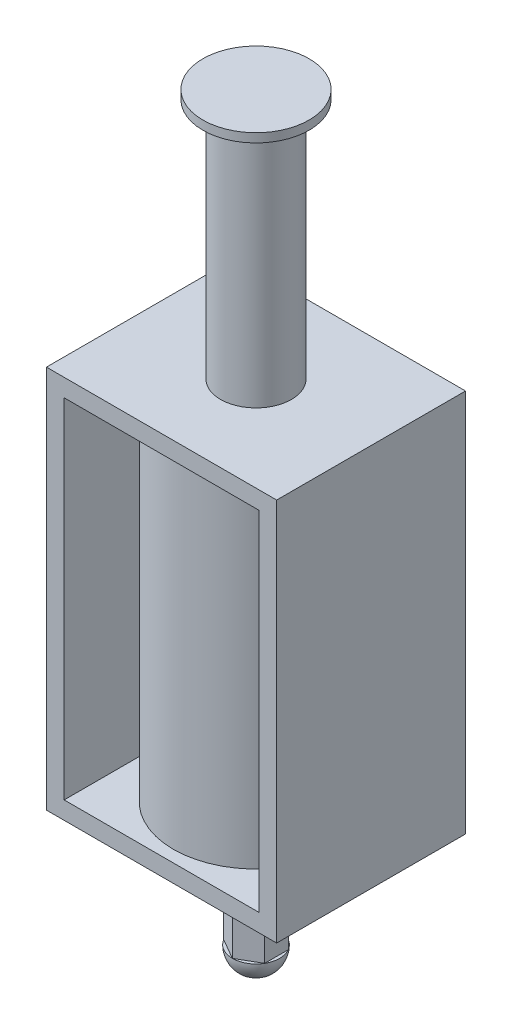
ISO-10303-21;
HEADER;
FILE_DESCRIPTION(('STEP AP214'),'2;1');
FILE_NAME('part.step','',(''),(''),'','','');
FILE_SCHEMA(('AUTOMOTIVE_DESIGN { 1 0 10303 214 1 1 1 1 }'));
ENDSEC;
DATA;
#1=APPLICATION_CONTEXT('core data for automotive mechanical design processes');
#2=APPLICATION_PROTOCOL_DEFINITION('international standard','automotive_design',2000,#1);
#3=PRODUCT_CONTEXT('',#1,'mechanical');
#4=PRODUCT('Part','Part','',(#3));
#5=PRODUCT_RELATED_PRODUCT_CATEGORY('part','',(#4));
#6=PRODUCT_DEFINITION_FORMATION('','',#4);
#7=PRODUCT_DEFINITION_CONTEXT('part definition',#1,'design');
#8=PRODUCT_DEFINITION('design','',#6,#7);
#9=PRODUCT_DEFINITION_SHAPE('','',#8);
#10=(LENGTH_UNIT() NAMED_UNIT(*) SI_UNIT(.MILLI.,.METRE.));
#11=(NAMED_UNIT(*) PLANE_ANGLE_UNIT() SI_UNIT($,.RADIAN.));
#12=(NAMED_UNIT(*) SI_UNIT($,.STERADIAN.) SOLID_ANGLE_UNIT());
#13=UNCERTAINTY_MEASURE_WITH_UNIT(LENGTH_MEASURE(1.E-05),#10,'distance_accuracy_value','');
#14=(GEOMETRIC_REPRESENTATION_CONTEXT(3) GLOBAL_UNCERTAINTY_ASSIGNED_CONTEXT((#13)) GLOBAL_UNIT_ASSIGNED_CONTEXT((#10,
#11,#12)) REPRESENTATION_CONTEXT('',''));
#15=CARTESIAN_POINT('',(0.,0.,0.));
#16=DIRECTION('',(0.,0.,1.));
#17=DIRECTION('',(1.,0.,0.));
#18=AXIS2_PLACEMENT_3D('',#15,#16,#17);
#19=CARTESIAN_POINT('',(0.,-50.5,16.));
#20=DIRECTION('',(0.,1.,0.));
#21=DIRECTION('',(0.,0.,1.));
#22=AXIS2_PLACEMENT_3D('',#19,#20,#21);
#23=CYLINDRICAL_SURFACE('',#22,4.);
#24=CARTESIAN_POINT('',(0.,-32.5,16.));
#25=DIRECTION('',(0.,-1.,0.));
#26=DIRECTION('',(0.,0.,-1.));
#27=AXIS2_PLACEMENT_3D('',#24,#25,#26);
#28=CIRCLE('',#27,4.);
#29=CARTESIAN_POINT('',(0.,-32.5,12.));
#30=VERTEX_POINT('',#29);
#31=EDGE_CURVE('E222',#30,#30,#28,.T.);
#32=ORIENTED_EDGE('',*,*,#31,.T.);
#33=EDGE_LOOP('',(#32));
#34=FACE_BOUND('',#33,.T.);
#35=CARTESIAN_POINT('',(0.,-39.5,16.));
#36=DIRECTION('',(0.,-1.,0.));
#37=DIRECTION('',(0.,0.,-1.));
#38=AXIS2_PLACEMENT_3D('',#35,#36,#37);
#39=CIRCLE('',#38,4.);
#40=CARTESIAN_POINT('',(-3.46410161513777,-39.5,18.));
#41=VERTEX_POINT('',#40);
#42=CARTESIAN_POINT('',(-3.46410161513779,-39.5,14.));
#43=VERTEX_POINT('',#42);
#44=EDGE_CURVE('E12',#41,#43,#39,.T.);
#45=ORIENTED_EDGE('',*,*,#44,.F.);
#46=CARTESIAN_POINT('',(0.,-39.5,20.));
#47=VERTEX_POINT('',#46);
#48=EDGE_CURVE('E53',#47,#41,#39,.T.);
#49=ORIENTED_EDGE('',*,*,#48,.F.);
#50=CARTESIAN_POINT('',(3.46410161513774,-39.5,18.));
#51=VERTEX_POINT('',#50);
#52=EDGE_CURVE('E671',#51,#47,#39,.T.);
#53=ORIENTED_EDGE('',*,*,#52,.F.);
#54=CARTESIAN_POINT('',(3.46410161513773,-39.5,14.));
#55=VERTEX_POINT('',#54);
#56=EDGE_CURVE('E668',#55,#51,#39,.T.);
#57=ORIENTED_EDGE('',*,*,#56,.F.);
#58=CARTESIAN_POINT('',(0.,-39.5,12.));
#59=VERTEX_POINT('',#58);
#60=EDGE_CURVE('E667',#59,#55,#39,.T.);
#61=ORIENTED_EDGE('',*,*,#60,.F.);
#62=EDGE_CURVE('E48',#43,#59,#39,.T.);
#63=ORIENTED_EDGE('',*,*,#62,.F.);
#64=EDGE_LOOP('',(#45,#49,#53,#57,#61,#63));
#65=FACE_BOUND('',#64,.T.);
#66=ADVANCED_FACE('F44',(#34,#65),#23,.T.);
#67=CARTESIAN_POINT('',(-19.5,-32.5,32.));
#68=DIRECTION('',(0.,1.,0.));
#69=DIRECTION('',(0.,0.,1.));
#70=AXIS2_PLACEMENT_3D('',#67,#68,#69);
#71=PLANE('',#70);
#72=ORIENTED_EDGE('',*,*,#31,.F.);
#73=EDGE_LOOP('',(#72));
#74=FACE_BOUND('',#73,.T.);
#75=DIRECTION('',(1.,0.,0.));
#76=VECTOR('',#75,1.);
#77=CARTESIAN_POINT('',(-19.5,-32.5,0.));
#78=LINE('',#77,#76);
#79=CARTESIAN_POINT('',(-19.5,-32.5,0.));
#80=VERTEX_POINT('',#79);
#81=CARTESIAN_POINT('',(19.5,-32.5,0.));
#82=VERTEX_POINT('',#81);
#83=EDGE_CURVE('E264',#80,#82,#78,.T.);
#84=ORIENTED_EDGE('',*,*,#83,.T.);
#85=DIRECTION('',(0.,0.,-1.));
#86=VECTOR('',#85,1.);
#87=CARTESIAN_POINT('',(19.5,-32.5,32.));
#88=LINE('',#87,#86);
#89=CARTESIAN_POINT('',(19.5,-32.5,32.));
#90=VERTEX_POINT('',#89);
#91=EDGE_CURVE('E238',#90,#82,#88,.T.);
#92=ORIENTED_EDGE('',*,*,#91,.F.);
#93=DIRECTION('',(1.,0.,0.));
#94=VECTOR('',#93,1.);
#95=CARTESIAN_POINT('',(-19.5,-32.5,32.));
#96=LINE('',#95,#94);
#97=CARTESIAN_POINT('',(-19.5,-32.5,32.));
#98=VERTEX_POINT('',#97);
#99=EDGE_CURVE('E270',#98,#90,#96,.T.);
#100=ORIENTED_EDGE('',*,*,#99,.F.);
#101=DIRECTION('',(0.,0.,-1.));
#102=VECTOR('',#101,1.);
#103=CARTESIAN_POINT('',(-19.5,-32.5,32.));
#104=LINE('',#103,#102);
#105=EDGE_CURVE('E281',#98,#80,#104,.T.);
#106=ORIENTED_EDGE('',*,*,#105,.T.);
#107=EDGE_LOOP('',(#84,#92,#100,#106));
#108=FACE_BOUND('',#107,.T.);
#109=ADVANCED_FACE('F46',(#74,#108),#71,.F.);
#110=CARTESIAN_POINT('',(19.5,32.5,32.));
#111=DIRECTION('',(1.,0.,0.));
#112=DIRECTION('',(0.,1.,0.));
#113=AXIS2_PLACEMENT_3D('',#110,#111,#112);
#114=PLANE('',#113);
#115=DIRECTION('',(0.,-1.,0.));
#116=VECTOR('',#115,1.);
#117=CARTESIAN_POINT('',(19.5,32.5,0.));
#118=LINE('',#117,#116);
#119=CARTESIAN_POINT('',(19.5,32.5,0.));
#120=VERTEX_POINT('',#119);
#121=EDGE_CURVE('E284',#120,#82,#118,.T.);
#122=ORIENTED_EDGE('',*,*,#121,.F.);
#123=DIRECTION('',(0.,0.,-1.));
#124=VECTOR('',#123,1.);
#125=CARTESIAN_POINT('',(19.5,32.5,32.));
#126=LINE('',#125,#124);
#127=CARTESIAN_POINT('',(19.5,32.5,32.));
#128=VERTEX_POINT('',#127);
#129=EDGE_CURVE('E295',#128,#120,#126,.T.);
#130=ORIENTED_EDGE('',*,*,#129,.F.);
#131=DIRECTION('',(0.,-1.,0.));
#132=VECTOR('',#131,1.);
#133=CARTESIAN_POINT('',(19.5,32.5,32.));
#134=LINE('',#133,#132);
#135=EDGE_CURVE('E272',#128,#90,#134,.T.);
#136=ORIENTED_EDGE('',*,*,#135,.T.);
#137=ORIENTED_EDGE('',*,*,#91,.T.);
#138=EDGE_LOOP('',(#122,#130,#136,#137));
#139=FACE_BOUND('',#138,.T.);
#140=ADVANCED_FACE('F344',(#139),#114,.T.);
#141=CARTESIAN_POINT('',(-19.5,32.5,32.));
#142=DIRECTION('',(0.,1.,0.));
#143=DIRECTION('',(0.,0.,1.));
#144=AXIS2_PLACEMENT_3D('',#141,#142,#143);
#145=PLANE('',#144);
#146=CARTESIAN_POINT('',(0.,32.5,16.));
#147=DIRECTION('',(0.,1.,0.));
#148=DIRECTION('',(0.,0.,1.));
#149=AXIS2_PLACEMENT_3D('',#146,#147,#148);
#150=CIRCLE('',#149,6.);
#151=CARTESIAN_POINT('',(0.,32.5,22.));
#152=VERTEX_POINT('',#151);
#153=EDGE_CURVE('E234',#152,#152,#150,.T.);
#154=ORIENTED_EDGE('',*,*,#153,.F.);
#155=EDGE_LOOP('',(#154));
#156=FACE_BOUND('',#155,.T.);
#157=DIRECTION('',(1.,0.,0.));
#158=VECTOR('',#157,1.);
#159=CARTESIAN_POINT('',(-19.5,32.5,0.));
#160=LINE('',#159,#158);
#161=CARTESIAN_POINT('',(-19.5,32.5,0.));
#162=VERTEX_POINT('',#161);
#163=EDGE_CURVE('E287',#162,#120,#160,.T.);
#164=ORIENTED_EDGE('',*,*,#163,.F.);
#165=DIRECTION('',(0.,0.,-1.));
#166=VECTOR('',#165,1.);
#167=CARTESIAN_POINT('',(-19.5,32.5,32.));
#168=LINE('',#167,#166);
#169=CARTESIAN_POINT('',(-19.5,32.5,32.));
#170=VERTEX_POINT('',#169);
#171=EDGE_CURVE('E293',#170,#162,#168,.T.);
#172=ORIENTED_EDGE('',*,*,#171,.F.);
#173=DIRECTION('',(1.,0.,0.));
#174=VECTOR('',#173,1.);
#175=CARTESIAN_POINT('',(-19.5,32.5,32.));
#176=LINE('',#175,#174);
#177=EDGE_CURVE('E276',#170,#128,#176,.T.);
#178=ORIENTED_EDGE('',*,*,#177,.T.);
#179=ORIENTED_EDGE('',*,*,#129,.T.);
#180=EDGE_LOOP('',(#164,#172,#178,#179));
#181=FACE_BOUND('',#180,.T.);
#182=ADVANCED_FACE('F373',(#156,#181),#145,.T.);
#183=CARTESIAN_POINT('',(-19.5,32.5,32.));
#184=DIRECTION('',(1.,0.,0.));
#185=DIRECTION('',(0.,1.,0.));
#186=AXIS2_PLACEMENT_3D('',#183,#184,#185);
#187=PLANE('',#186);
#188=DIRECTION('',(0.,-1.,0.));
#189=VECTOR('',#188,1.);
#190=CARTESIAN_POINT('',(-19.5,32.5,0.));
#191=LINE('',#190,#189);
#192=EDGE_CURVE('E273',#162,#80,#191,.T.);
#193=ORIENTED_EDGE('',*,*,#192,.T.);
#194=ORIENTED_EDGE('',*,*,#105,.F.);
#195=DIRECTION('',(0.,-1.,0.));
#196=VECTOR('',#195,1.);
#197=CARTESIAN_POINT('',(-19.5,32.5,32.));
#198=LINE('',#197,#196);
#199=EDGE_CURVE('E279',#170,#98,#198,.T.);
#200=ORIENTED_EDGE('',*,*,#199,.F.);
#201=ORIENTED_EDGE('',*,*,#171,.T.);
#202=EDGE_LOOP('',(#193,#194,#200,#201));
#203=FACE_BOUND('',#202,.T.);
#204=ADVANCED_FACE('F375',(#203),#187,.F.);
#205=CARTESIAN_POINT('',(0.,0.,32.));
#206=DIRECTION('',(0.,0.,-1.));
#207=DIRECTION('',(-1.,0.,0.));
#208=AXIS2_PLACEMENT_3D('',#205,#206,#207);
#209=PLANE('',#208);
#210=DIRECTION('',(-1.,0.,0.));
#211=VECTOR('',#210,1.);
#212=CARTESIAN_POINT('',(-16.5,29.5,32.));
#213=LINE('',#212,#211);
#214=CARTESIAN_POINT('',(16.5,29.5,32.));
#215=VERTEX_POINT('',#214);
#216=CARTESIAN_POINT('',(-16.5,29.5,32.));
#217=VERTEX_POINT('',#216);
#218=EDGE_CURVE('E254',#215,#217,#213,.T.);
#219=ORIENTED_EDGE('',*,*,#218,.F.);
#220=DIRECTION('',(0.,1.,0.));
#221=VECTOR('',#220,1.);
#222=CARTESIAN_POINT('',(16.5,29.5,32.));
#223=LINE('',#222,#221);
#224=CARTESIAN_POINT('',(16.5,-29.5,32.));
#225=VERTEX_POINT('',#224);
#226=EDGE_CURVE('E68',#225,#215,#223,.T.);
#227=ORIENTED_EDGE('',*,*,#226,.F.);
#228=DIRECTION('',(1.,0.,0.));
#229=VECTOR('',#228,1.);
#230=CARTESIAN_POINT('',(-16.5,-29.5,32.));
#231=LINE('',#230,#229);
#232=CARTESIAN_POINT('',(-16.5,-29.5,32.));
#233=VERTEX_POINT('',#232);
#234=EDGE_CURVE('E243',#233,#225,#231,.T.);
#235=ORIENTED_EDGE('',*,*,#234,.F.);
#236=DIRECTION('',(0.,-1.,0.));
#237=VECTOR('',#236,1.);
#238=CARTESIAN_POINT('',(-16.5,29.5,32.));
#239=LINE('',#238,#237);
#240=EDGE_CURVE('E257',#217,#233,#239,.T.);
#241=ORIENTED_EDGE('',*,*,#240,.F.);
#242=EDGE_LOOP('',(#219,#227,#235,#241));
#243=FACE_BOUND('',#242,.T.);
#244=ORIENTED_EDGE('',*,*,#99,.T.);
#245=ORIENTED_EDGE('',*,*,#135,.F.);
#246=ORIENTED_EDGE('',*,*,#177,.F.);
#247=ORIENTED_EDGE('',*,*,#199,.T.);
#248=EDGE_LOOP('',(#244,#245,#246,#247));
#249=FACE_BOUND('',#248,.T.);
#250=ADVANCED_FACE('F317',(#243,#249),#209,.F.);
#251=CARTESIAN_POINT('',(0.,0.,0.));
#252=DIRECTION('',(0.,0.,-1.));
#253=DIRECTION('',(-1.,0.,0.));
#254=AXIS2_PLACEMENT_3D('',#251,#252,#253);
#255=PLANE('',#254);
#256=DIRECTION('',(0.,1.,0.));
#257=VECTOR('',#256,1.);
#258=CARTESIAN_POINT('',(16.5,29.5,0.));
#259=LINE('',#258,#257);
#260=CARTESIAN_POINT('',(16.5,-29.5,0.));
#261=VERTEX_POINT('',#260);
#262=CARTESIAN_POINT('',(16.5,29.5,0.));
#263=VERTEX_POINT('',#262);
#264=EDGE_CURVE('E239',#261,#263,#259,.T.);
#265=ORIENTED_EDGE('',*,*,#264,.T.);
#266=DIRECTION('',(-1.,0.,0.));
#267=VECTOR('',#266,1.);
#268=CARTESIAN_POINT('',(-16.5,29.5,0.));
#269=LINE('',#268,#267);
#270=CARTESIAN_POINT('',(-16.5,29.5,0.));
#271=VERTEX_POINT('',#270);
#272=EDGE_CURVE('E242',#263,#271,#269,.T.);
#273=ORIENTED_EDGE('',*,*,#272,.T.);
#274=DIRECTION('',(0.,-1.,0.));
#275=VECTOR('',#274,1.);
#276=CARTESIAN_POINT('',(-16.5,29.5,0.));
#277=LINE('',#276,#275);
#278=CARTESIAN_POINT('',(-16.5,-29.5,0.));
#279=VERTEX_POINT('',#278);
#280=EDGE_CURVE('E246',#271,#279,#277,.T.);
#281=ORIENTED_EDGE('',*,*,#280,.T.);
#282=DIRECTION('',(1.,0.,0.));
#283=VECTOR('',#282,1.);
#284=CARTESIAN_POINT('',(-16.5,-29.5,0.));
#285=LINE('',#284,#283);
#286=EDGE_CURVE('E249',#279,#261,#285,.T.);
#287=ORIENTED_EDGE('',*,*,#286,.T.);
#288=EDGE_LOOP('',(#265,#273,#281,#287));
#289=FACE_BOUND('',#288,.T.);
#290=ORIENTED_EDGE('',*,*,#83,.F.);
#291=ORIENTED_EDGE('',*,*,#192,.F.);
#292=ORIENTED_EDGE('',*,*,#163,.T.);
#293=ORIENTED_EDGE('',*,*,#121,.T.);
#294=EDGE_LOOP('',(#290,#291,#292,#293));
#295=FACE_BOUND('',#294,.T.);
#296=ADVANCED_FACE('F324',(#289,#295),#255,.T.);
#297=CARTESIAN_POINT('',(16.5,29.5,0.));
#298=DIRECTION('',(1.,0.,0.));
#299=DIRECTION('',(0.,0.,-1.));
#300=AXIS2_PLACEMENT_3D('',#297,#298,#299);
#301=PLANE('',#300);
#302=ORIENTED_EDGE('',*,*,#226,.T.);
#303=DIRECTION('',(0.,0.,1.));
#304=VECTOR('',#303,1.);
#305=CARTESIAN_POINT('',(16.5,29.5,0.));
#306=LINE('',#305,#304);
#307=EDGE_CURVE('E252',#263,#215,#306,.T.);
#308=ORIENTED_EDGE('',*,*,#307,.F.);
#309=ORIENTED_EDGE('',*,*,#264,.F.);
#310=DIRECTION('',(0.,0.,1.));
#311=VECTOR('',#310,1.);
#312=CARTESIAN_POINT('',(16.5,-29.5,0.));
#313=LINE('',#312,#311);
#314=EDGE_CURVE('E262',#261,#225,#313,.T.);
#315=ORIENTED_EDGE('',*,*,#314,.T.);
#316=EDGE_LOOP('',(#302,#308,#309,#315));
#317=FACE_BOUND('',#316,.T.);
#318=ADVANCED_FACE('F309',(#317),#301,.F.);
#319=CARTESIAN_POINT('',(-16.5,-29.5,0.));
#320=DIRECTION('',(0.,-1.,0.));
#321=DIRECTION('',(0.,0.,-1.));
#322=AXIS2_PLACEMENT_3D('',#319,#320,#321);
#323=PLANE('',#322);
#324=CARTESIAN_POINT('',(0.,-29.5,16.));
#325=DIRECTION('',(0.,-1.,0.));
#326=DIRECTION('',(0.,0.,-1.));
#327=AXIS2_PLACEMENT_3D('',#324,#325,#326);
#328=CIRCLE('',#327,14.);
#329=CARTESIAN_POINT('',(0.,-29.5,2.));
#330=VERTEX_POINT('',#329);
#331=EDGE_CURVE('E225',#330,#330,#328,.F.);
#332=ORIENTED_EDGE('',*,*,#331,.F.);
#333=EDGE_LOOP('',(#332));
#334=FACE_BOUND('',#333,.T.);
#335=ORIENTED_EDGE('',*,*,#234,.T.);
#336=ORIENTED_EDGE('',*,*,#314,.F.);
#337=ORIENTED_EDGE('',*,*,#286,.F.);
#338=DIRECTION('',(0.,0.,1.));
#339=VECTOR('',#338,1.);
#340=CARTESIAN_POINT('',(-16.5,-29.5,0.));
#341=LINE('',#340,#339);
#342=EDGE_CURVE('E265',#279,#233,#341,.T.);
#343=ORIENTED_EDGE('',*,*,#342,.T.);
#344=EDGE_LOOP('',(#335,#336,#337,#343));
#345=FACE_BOUND('',#344,.T.);
#346=ADVANCED_FACE('F305',(#334,#345),#323,.F.);
#347=CARTESIAN_POINT('',(-16.5,29.5,0.));
#348=DIRECTION('',(-1.,0.,0.));
#349=DIRECTION('',(0.,0.,1.));
#350=AXIS2_PLACEMENT_3D('',#347,#348,#349);
#351=PLANE('',#350);
#352=ORIENTED_EDGE('',*,*,#240,.T.);
#353=ORIENTED_EDGE('',*,*,#342,.F.);
#354=ORIENTED_EDGE('',*,*,#280,.F.);
#355=DIRECTION('',(0.,0.,1.));
#356=VECTOR('',#355,1.);
#357=CARTESIAN_POINT('',(-16.5,29.5,0.));
#358=LINE('',#357,#356);
#359=EDGE_CURVE('E267',#271,#217,#358,.T.);
#360=ORIENTED_EDGE('',*,*,#359,.T.);
#361=EDGE_LOOP('',(#352,#353,#354,#360));
#362=FACE_BOUND('',#361,.T.);
#363=ADVANCED_FACE('F308',(#362),#351,.F.);
#364=CARTESIAN_POINT('',(-16.5,29.5,0.));
#365=DIRECTION('',(0.,1.,0.));
#366=DIRECTION('',(0.,0.,1.));
#367=AXIS2_PLACEMENT_3D('',#364,#365,#366);
#368=PLANE('',#367);
#369=CARTESIAN_POINT('',(0.,29.5,16.));
#370=DIRECTION('',(0.,1.,0.));
#371=DIRECTION('',(0.,0.,1.));
#372=AXIS2_PLACEMENT_3D('',#369,#370,#371);
#373=CIRCLE('',#372,14.);
#374=CARTESIAN_POINT('',(0.,29.5,30.));
#375=VERTEX_POINT('',#374);
#376=EDGE_CURVE('E237',#375,#375,#373,.F.);
#377=ORIENTED_EDGE('',*,*,#376,.F.);
#378=EDGE_LOOP('',(#377));
#379=FACE_BOUND('',#378,.T.);
#380=ORIENTED_EDGE('',*,*,#218,.T.);
#381=ORIENTED_EDGE('',*,*,#359,.F.);
#382=ORIENTED_EDGE('',*,*,#272,.F.);
#383=ORIENTED_EDGE('',*,*,#307,.T.);
#384=EDGE_LOOP('',(#380,#381,#382,#383));
#385=FACE_BOUND('',#384,.T.);
#386=ADVANCED_FACE('F321',(#379,#385),#368,.F.);
#387=CARTESIAN_POINT('',(0.,73.5,16.));
#388=DIRECTION('',(0.,-1.,0.));
#389=DIRECTION('',(0.,0.,-1.));
#390=AXIS2_PLACEMENT_3D('',#387,#388,#389);
#391=CYLINDRICAL_SURFACE('',#390,6.);
#392=CARTESIAN_POINT('',(0.,73.5,16.));
#393=DIRECTION('',(0.,1.,0.));
#394=DIRECTION('',(0.,0.,1.));
#395=AXIS2_PLACEMENT_3D('',#392,#393,#394);
#396=CIRCLE('',#395,6.);
#397=CARTESIAN_POINT('',(0.,73.5,22.));
#398=VERTEX_POINT('',#397);
#399=EDGE_CURVE('E229',#398,#398,#396,.T.);
#400=ORIENTED_EDGE('',*,*,#399,.F.);
#401=EDGE_LOOP('',(#400));
#402=FACE_BOUND('',#401,.T.);
#403=ORIENTED_EDGE('',*,*,#153,.T.);
#404=EDGE_LOOP('',(#403));
#405=FACE_BOUND('',#404,.T.);
#406=ADVANCED_FACE('F334',(#402,#405),#391,.T.);
#407=CARTESIAN_POINT('',(0.,75.,16.));
#408=DIRECTION('',(0.,-1.,0.));
#409=DIRECTION('',(0.,0.,-1.));
#410=AXIS2_PLACEMENT_3D('',#407,#408,#409);
#411=CYLINDRICAL_SURFACE('',#410,9.);
#412=CARTESIAN_POINT('',(0.,75.,16.));
#413=DIRECTION('',(0.,1.,0.));
#414=DIRECTION('',(0.,0.,1.));
#415=AXIS2_PLACEMENT_3D('',#412,#413,#414);
#416=CIRCLE('',#415,9.);
#417=CARTESIAN_POINT('',(0.,75.,25.));
#418=VERTEX_POINT('',#417);
#419=EDGE_CURVE('E226',#418,#418,#416,.T.);
#420=ORIENTED_EDGE('',*,*,#419,.F.);
#421=EDGE_LOOP('',(#420));
#422=FACE_BOUND('',#421,.T.);
#423=CARTESIAN_POINT('',(0.,73.5,16.));
#424=DIRECTION('',(0.,1.,0.));
#425=DIRECTION('',(0.,0.,1.));
#426=AXIS2_PLACEMENT_3D('',#423,#424,#425);
#427=CIRCLE('',#426,9.);
#428=CARTESIAN_POINT('',(0.,73.5,25.));
#429=VERTEX_POINT('',#428);
#430=EDGE_CURVE('E215',#429,#429,#427,.T.);
#431=ORIENTED_EDGE('',*,*,#430,.T.);
#432=EDGE_LOOP('',(#431));
#433=FACE_BOUND('',#432,.T.);
#434=ADVANCED_FACE('F357',(#422,#433),#411,.T.);
#435=CARTESIAN_POINT('',(0.,75.,16.));
#436=DIRECTION('',(0.,1.,0.));
#437=DIRECTION('',(0.,0.,1.));
#438=AXIS2_PLACEMENT_3D('',#435,#436,#437);
#439=PLANE('',#438);
#440=ORIENTED_EDGE('',*,*,#419,.T.);
#441=EDGE_LOOP('',(#440));
#442=FACE_BOUND('',#441,.T.);
#443=ADVANCED_FACE('F354',(#442),#439,.T.);
#444=CARTESIAN_POINT('',(0.,73.5,16.));
#445=DIRECTION('',(0.,1.,0.));
#446=DIRECTION('',(0.,0.,1.));
#447=AXIS2_PLACEMENT_3D('',#444,#445,#446);
#448=PLANE('',#447);
#449=ORIENTED_EDGE('',*,*,#399,.T.);
#450=EDGE_LOOP('',(#449));
#451=FACE_BOUND('',#450,.T.);
#452=ORIENTED_EDGE('',*,*,#430,.F.);
#453=EDGE_LOOP('',(#452));
#454=FACE_BOUND('',#453,.T.);
#455=ADVANCED_FACE('F353',(#451,#454),#448,.F.);
#456=CARTESIAN_POINT('',(0.,-29.5,16.));
#457=DIRECTION('',(0.,1.,0.));
#458=DIRECTION('',(0.,0.,1.));
#459=AXIS2_PLACEMENT_3D('',#456,#457,#458);
#460=CYLINDRICAL_SURFACE('',#459,14.);
#461=ORIENTED_EDGE('',*,*,#331,.T.);
#462=EDGE_LOOP('',(#461));
#463=FACE_BOUND('',#462,.T.);
#464=ORIENTED_EDGE('',*,*,#376,.T.);
#465=EDGE_LOOP('',(#464));
#466=FACE_BOUND('',#465,.T.);
#467=ADVANCED_FACE('F302',(#463,#466),#460,.T.);
#468=CARTESIAN_POINT('',(0.,-39.5,16.));
#469=DIRECTION('',(0.,-1.,0.));
#470=DIRECTION('',(0.,0.,-1.));
#471=AXIS2_PLACEMENT_3D('',#468,#469,#470);
#472=PLANE('',#471);
#473=ORIENTED_EDGE('',*,*,#60,.T.);
#474=DIRECTION('',(0.866025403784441,0.,0.499999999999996));
#475=VECTOR('',#474,1.);
#476=CARTESIAN_POINT('',(3.46410161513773,-39.5,14.));
#477=LINE('',#476,#475);
#478=EDGE_CURVE('E196',#59,#55,#477,.T.);
#479=ORIENTED_EDGE('',*,*,#478,.F.);
#480=EDGE_LOOP('',(#473,#479));
#481=FACE_BOUND('',#480,.T.);
#482=ADVANCED_FACE('F349',(#481),#472,.T.);
#483=ORIENTED_EDGE('',*,*,#56,.T.);
#484=DIRECTION('',(0.,0.,1.));
#485=VECTOR('',#484,1.);
#486=CARTESIAN_POINT('',(3.46410161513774,-39.5,18.));
#487=LINE('',#486,#485);
#488=EDGE_CURVE('E199',#55,#51,#487,.T.);
#489=ORIENTED_EDGE('',*,*,#488,.F.);
#490=EDGE_LOOP('',(#483,#489));
#491=FACE_BOUND('',#490,.T.);
#492=ADVANCED_FACE('F492',(#491),#472,.T.);
#493=ORIENTED_EDGE('',*,*,#52,.T.);
#494=DIRECTION('',(-0.866025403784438,0.,0.5));
#495=VECTOR('',#494,1.);
#496=CARTESIAN_POINT('',(0.,-39.5,20.));
#497=LINE('',#496,#495);
#498=EDGE_CURVE('E202',#51,#47,#497,.T.);
#499=ORIENTED_EDGE('',*,*,#498,.F.);
#500=EDGE_LOOP('',(#493,#499));
#501=FACE_BOUND('',#500,.T.);
#502=ADVANCED_FACE('F501',(#501),#472,.T.);
#503=ORIENTED_EDGE('',*,*,#48,.T.);
#504=DIRECTION('',(-0.866025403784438,0.,-0.500000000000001));
#505=VECTOR('',#504,1.);
#506=CARTESIAN_POINT('',(-3.46410161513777,-39.5,18.));
#507=LINE('',#506,#505);
#508=EDGE_CURVE('E189',#47,#41,#507,.T.);
#509=ORIENTED_EDGE('',*,*,#508,.F.);
#510=EDGE_LOOP('',(#503,#509));
#511=FACE_BOUND('',#510,.T.);
#512=ADVANCED_FACE('F509',(#511),#472,.T.);
#513=ORIENTED_EDGE('',*,*,#44,.T.);
#514=DIRECTION('',(0.,0.,-1.));
#515=VECTOR('',#514,1.);
#516=CARTESIAN_POINT('',(-3.46410161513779,-39.5,14.));
#517=LINE('',#516,#515);
#518=EDGE_CURVE('E60',#41,#43,#517,.T.);
#519=ORIENTED_EDGE('',*,*,#518,.F.);
#520=EDGE_LOOP('',(#513,#519));
#521=FACE_BOUND('',#520,.T.);
#522=ADVANCED_FACE('F517',(#521),#472,.T.);
#523=ORIENTED_EDGE('',*,*,#62,.T.);
#524=DIRECTION('',(0.866025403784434,0.,-0.500000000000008));
#525=VECTOR('',#524,1.);
#526=CARTESIAN_POINT('',(0.,-39.5,12.));
#527=LINE('',#526,#525);
#528=EDGE_CURVE('E194',#43,#59,#527,.T.);
#529=ORIENTED_EDGE('',*,*,#528,.F.);
#530=EDGE_LOOP('',(#523,#529));
#531=FACE_BOUND('',#530,.T.);
#532=ADVANCED_FACE('F494',(#531),#472,.T.);
#533=CARTESIAN_POINT('',(-3.46410161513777,-39.5,18.));
#534=DIRECTION('',(-0.500000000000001,0.,0.866025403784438));
#535=DIRECTION('',(0.866025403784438,0.,0.500000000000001));
#536=AXIS2_PLACEMENT_3D('',#533,#534,#535);
#537=PLANE('',#536);
#538=DIRECTION('',(-0.866025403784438,0.,-0.500000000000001));
#539=VECTOR('',#538,1.);
#540=CARTESIAN_POINT('',(-3.46410161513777,-50.5,18.));
#541=LINE('',#540,#539);
#542=CARTESIAN_POINT('',(0.,-50.5,20.));
#543=VERTEX_POINT('',#542);
#544=CARTESIAN_POINT('',(-3.46410161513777,-50.5,18.));
#545=VERTEX_POINT('',#544);
#546=EDGE_CURVE('E173',#543,#545,#541,.T.);
#547=ORIENTED_EDGE('',*,*,#546,.F.);
#548=DIRECTION('',(0.,-1.,0.));
#549=VECTOR('',#548,1.);
#550=CARTESIAN_POINT('',(0.,-39.5,20.));
#551=LINE('',#550,#549);
#552=EDGE_CURVE('E213',#47,#543,#551,.T.);
#553=ORIENTED_EDGE('',*,*,#552,.F.);
#554=ORIENTED_EDGE('',*,*,#508,.T.);
#555=DIRECTION('',(0.,-1.,0.));
#556=VECTOR('',#555,1.);
#557=CARTESIAN_POINT('',(-3.46410161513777,-39.5,18.));
#558=LINE('',#557,#556);
#559=EDGE_CURVE('E155',#41,#545,#558,.T.);
#560=ORIENTED_EDGE('',*,*,#559,.T.);
#561=EDGE_LOOP('',(#547,#553,#554,#560));
#562=FACE_BOUND('',#561,.T.);
#563=ADVANCED_FACE('F532',(#562),#537,.T.);
#564=CARTESIAN_POINT('',(0.,-39.5,20.));
#565=DIRECTION('',(0.5,0.,0.866025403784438));
#566=DIRECTION('',(0.866025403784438,0.,-0.5));
#567=AXIS2_PLACEMENT_3D('',#564,#565,#566);
#568=PLANE('',#567);
#569=DIRECTION('',(-0.866025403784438,0.,0.5));
#570=VECTOR('',#569,1.);
#571=CARTESIAN_POINT('',(0.,-50.5,20.));
#572=LINE('',#571,#570);
#573=CARTESIAN_POINT('',(3.46410161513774,-50.5,18.));
#574=VERTEX_POINT('',#573);
#575=EDGE_CURVE('E192',#574,#543,#572,.T.);
#576=ORIENTED_EDGE('',*,*,#575,.F.);
#577=DIRECTION('',(0.,-1.,0.));
#578=VECTOR('',#577,1.);
#579=CARTESIAN_POINT('',(3.46410161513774,-39.5,18.));
#580=LINE('',#579,#578);
#581=EDGE_CURVE('E216',#51,#574,#580,.T.);
#582=ORIENTED_EDGE('',*,*,#581,.F.);
#583=ORIENTED_EDGE('',*,*,#498,.T.);
#584=ORIENTED_EDGE('',*,*,#552,.T.);
#585=EDGE_LOOP('',(#576,#582,#583,#584));
#586=FACE_BOUND('',#585,.T.);
#587=ADVANCED_FACE('F540',(#586),#568,.T.);
#588=CARTESIAN_POINT('',(3.46410161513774,-39.5,18.));
#589=DIRECTION('',(1.,0.,0.));
#590=DIRECTION('',(0.,0.,-1.));
#591=AXIS2_PLACEMENT_3D('',#588,#589,#590);
#592=PLANE('',#591);
#593=DIRECTION('',(0.,0.,1.));
#594=VECTOR('',#593,1.);
#595=CARTESIAN_POINT('',(3.46410161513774,-50.5,18.));
#596=LINE('',#595,#594);
#597=CARTESIAN_POINT('',(3.46410161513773,-50.5,14.));
#598=VERTEX_POINT('',#597);
#599=EDGE_CURVE('E208',#598,#574,#596,.T.);
#600=ORIENTED_EDGE('',*,*,#599,.F.);
#601=DIRECTION('',(0.,-1.,0.));
#602=VECTOR('',#601,1.);
#603=CARTESIAN_POINT('',(3.46410161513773,-39.5,14.));
#604=LINE('',#603,#602);
#605=EDGE_CURVE('E218',#55,#598,#604,.T.);
#606=ORIENTED_EDGE('',*,*,#605,.F.);
#607=ORIENTED_EDGE('',*,*,#488,.T.);
#608=ORIENTED_EDGE('',*,*,#581,.T.);
#609=EDGE_LOOP('',(#600,#606,#607,#608));
#610=FACE_BOUND('',#609,.T.);
#611=ADVANCED_FACE('F548',(#610),#592,.T.);
#612=CARTESIAN_POINT('',(3.46410161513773,-39.5,14.));
#613=DIRECTION('',(0.499999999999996,0.,-0.866025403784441));
#614=DIRECTION('',(-0.866025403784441,0.,-0.499999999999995));
#615=AXIS2_PLACEMENT_3D('',#612,#613,#614);
#616=PLANE('',#615);
#617=DIRECTION('',(0.866025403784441,0.,0.499999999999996));
#618=VECTOR('',#617,1.);
#619=CARTESIAN_POINT('',(3.46410161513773,-50.5,14.));
#620=LINE('',#619,#618);
#621=CARTESIAN_POINT('',(0.,-50.5,12.));
#622=VERTEX_POINT('',#621);
#623=EDGE_CURVE('E165',#622,#598,#620,.T.);
#624=ORIENTED_EDGE('',*,*,#623,.F.);
#625=DIRECTION('',(0.,-1.,0.));
#626=VECTOR('',#625,1.);
#627=CARTESIAN_POINT('',(0.,-39.5,12.));
#628=LINE('',#627,#626);
#629=EDGE_CURVE('E154',#59,#622,#628,.T.);
#630=ORIENTED_EDGE('',*,*,#629,.F.);
#631=ORIENTED_EDGE('',*,*,#478,.T.);
#632=ORIENTED_EDGE('',*,*,#605,.T.);
#633=EDGE_LOOP('',(#624,#630,#631,#632));
#634=FACE_BOUND('',#633,.T.);
#635=ADVANCED_FACE('F557',(#634),#616,.T.);
#636=CARTESIAN_POINT('',(0.,-39.5,12.));
#637=DIRECTION('',(-0.500000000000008,0.,-0.866025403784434));
#638=DIRECTION('',(-0.866025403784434,0.,0.500000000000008));
#639=AXIS2_PLACEMENT_3D('',#636,#637,#638);
#640=PLANE('',#639);
#641=DIRECTION('',(0.866025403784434,0.,-0.500000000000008));
#642=VECTOR('',#641,1.);
#643=CARTESIAN_POINT('',(0.,-50.5,12.));
#644=LINE('',#643,#642);
#645=CARTESIAN_POINT('',(-3.46410161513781,-50.5,14.));
#646=VERTEX_POINT('',#645);
#647=EDGE_CURVE('E158',#646,#622,#644,.T.);
#648=ORIENTED_EDGE('',*,*,#647,.F.);
#649=DIRECTION('',(0.,-1.,0.));
#650=VECTOR('',#649,1.);
#651=CARTESIAN_POINT('',(-3.46410161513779,-39.5,14.));
#652=LINE('',#651,#650);
#653=EDGE_CURVE('E145',#43,#646,#652,.T.);
#654=ORIENTED_EDGE('',*,*,#653,.F.);
#655=ORIENTED_EDGE('',*,*,#528,.T.);
#656=ORIENTED_EDGE('',*,*,#629,.T.);
#657=EDGE_LOOP('',(#648,#654,#655,#656));
#658=FACE_BOUND('',#657,.T.);
#659=ADVANCED_FACE('F159',(#658),#640,.T.);
#660=CARTESIAN_POINT('',(-3.46410161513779,-39.5,14.));
#661=DIRECTION('',(-1.,0.,0.));
#662=DIRECTION('',(0.,0.,1.));
#663=AXIS2_PLACEMENT_3D('',#660,#661,#662);
#664=PLANE('',#663);
#665=DIRECTION('',(0.,0.,-1.));
#666=VECTOR('',#665,1.);
#667=CARTESIAN_POINT('',(-3.46410161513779,-50.5,14.));
#668=LINE('',#667,#666);
#669=EDGE_CURVE('E149',#545,#646,#668,.T.);
#670=ORIENTED_EDGE('',*,*,#669,.F.);
#671=ORIENTED_EDGE('',*,*,#559,.F.);
#672=ORIENTED_EDGE('',*,*,#518,.T.);
#673=ORIENTED_EDGE('',*,*,#653,.T.);
#674=EDGE_LOOP('',(#670,#671,#672,#673));
#675=FACE_BOUND('',#674,.T.);
#676=ADVANCED_FACE('F147',(#675),#664,.T.);
#677=CARTESIAN_POINT('',(3.46410161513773,-50.5,14.));
#678=DIRECTION('',(0.,-1.,0.));
#679=DIRECTION('',(1.,0.,0.));
#680=AXIS2_PLACEMENT_3D('',#677,#678,#679);
#681=PLANE('',#680);
#682=ORIENTED_EDGE('',*,*,#546,.T.);
#683=CARTESIAN_POINT('',(0.,-50.5,16.));
#684=DIRECTION('',(0.,1.,0.));
#685=DIRECTION('',(-1.,0.,0.));
#686=AXIS2_PLACEMENT_3D('',#683,#684,#685);
#687=CIRCLE('',#686,4.);
#688=EDGE_CURVE('E182',#545,#543,#687,.T.);
#689=ORIENTED_EDGE('',*,*,#688,.T.);
#690=EDGE_LOOP('',(#682,#689));
#691=FACE_BOUND('',#690,.T.);
#692=ADVANCED_FACE('F581',(#691),#681,.F.);
#693=ORIENTED_EDGE('',*,*,#575,.T.);
#694=EDGE_CURVE('E188',#543,#574,#687,.T.);
#695=ORIENTED_EDGE('',*,*,#694,.T.);
#696=EDGE_LOOP('',(#693,#695));
#697=FACE_BOUND('',#696,.T.);
#698=ADVANCED_FACE('F589',(#697),#681,.F.);
#699=ORIENTED_EDGE('',*,*,#599,.T.);
#700=EDGE_CURVE('E186',#574,#598,#687,.T.);
#701=ORIENTED_EDGE('',*,*,#700,.T.);
#702=EDGE_LOOP('',(#699,#701));
#703=FACE_BOUND('',#702,.T.);
#704=ADVANCED_FACE('F598',(#703),#681,.F.);
#705=ORIENTED_EDGE('',*,*,#623,.T.);
#706=EDGE_CURVE('E185',#598,#622,#687,.T.);
#707=ORIENTED_EDGE('',*,*,#706,.T.);
#708=EDGE_LOOP('',(#705,#707));
#709=FACE_BOUND('',#708,.T.);
#710=ADVANCED_FACE('F606',(#709),#681,.F.);
#711=ORIENTED_EDGE('',*,*,#647,.T.);
#712=EDGE_CURVE('E178',#622,#646,#687,.T.);
#713=ORIENTED_EDGE('',*,*,#712,.T.);
#714=EDGE_LOOP('',(#711,#713));
#715=FACE_BOUND('',#714,.T.);
#716=ADVANCED_FACE('F184',(#715),#681,.F.);
#717=CARTESIAN_POINT('',(0.,-50.5,16.));
#718=DIRECTION('',(0.,1.,0.));
#719=DIRECTION('',(-0.866025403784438,0.,0.500000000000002));
#720=AXIS2_PLACEMENT_3D('',#717,#718,#719);
#721=SPHERICAL_SURFACE('',#720,4.00000000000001);
#722=ORIENTED_EDGE('',*,*,#688,.F.);
#723=EDGE_CURVE('E171',#646,#545,#687,.T.);
#724=ORIENTED_EDGE('',*,*,#723,.F.);
#725=ORIENTED_EDGE('',*,*,#712,.F.);
#726=ORIENTED_EDGE('',*,*,#706,.F.);
#727=ORIENTED_EDGE('',*,*,#700,.F.);
#728=ORIENTED_EDGE('',*,*,#694,.F.);
#729=EDGE_LOOP('',(#722,#724,#725,#726,#727,#728));
#730=FACE_BOUND('',#729,.T.);
#731=ADVANCED_FACE('F176',(#730),#721,.T.);
#732=ORIENTED_EDGE('',*,*,#669,.T.);
#733=ORIENTED_EDGE('',*,*,#723,.T.);
#734=EDGE_LOOP('',(#732,#733));
#735=FACE_BOUND('',#734,.T.);
#736=ADVANCED_FACE('F170',(#735),#681,.F.);
#737=CLOSED_SHELL('',(#66,#109,#140,#182,#204,#250,#296,#318,#346,#363,#386,#406,#434,#443,#455,
#467,#482,#492,#502,#512,#522,#532,#563,#587,#611,#635,#659,#676,#692,#698,#704,#710,#716,#731,#736));
#738=MANIFOLD_SOLID_BREP('B2',#737);
#739=ADVANCED_BREP_SHAPE_REPRESENTATION('',(#18,#738),#14);
#740=SHAPE_DEFINITION_REPRESENTATION(#9,#739);
ENDSEC;
END-ISO-10303-21;
